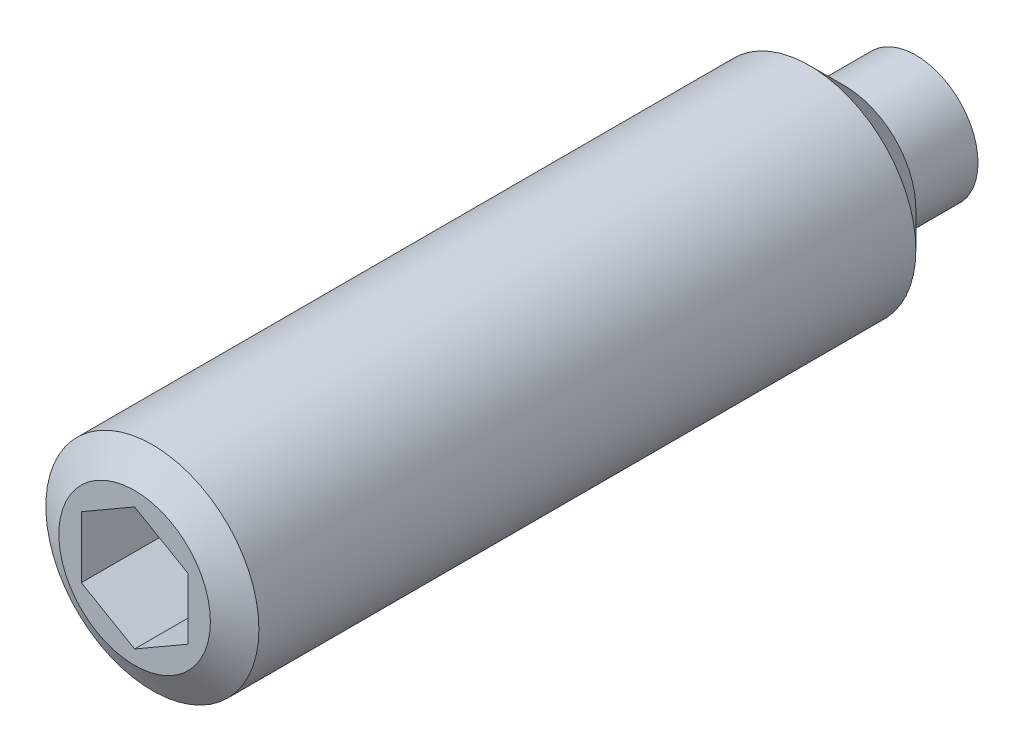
ISO-10303-21;
HEADER;
FILE_DESCRIPTION(('STEP AP214'),'2;1');
FILE_NAME('part.step','',(''),(''),'','','');
FILE_SCHEMA(('AUTOMOTIVE_DESIGN { 1 0 10303 214 1 1 1 1 }'));
ENDSEC;
DATA;
#1=APPLICATION_CONTEXT('core data for automotive mechanical design processes');
#2=APPLICATION_PROTOCOL_DEFINITION('international standard','automotive_design',2000,#1);
#3=PRODUCT_CONTEXT('',#1,'mechanical');
#4=PRODUCT('Part','Part','',(#3));
#5=PRODUCT_RELATED_PRODUCT_CATEGORY('part','',(#4));
#6=PRODUCT_DEFINITION_FORMATION('','',#4);
#7=PRODUCT_DEFINITION_CONTEXT('part definition',#1,'design');
#8=PRODUCT_DEFINITION('design','',#6,#7);
#9=PRODUCT_DEFINITION_SHAPE('','',#8);
#10=(LENGTH_UNIT() NAMED_UNIT(*) SI_UNIT(.MILLI.,.METRE.));
#11=(NAMED_UNIT(*) PLANE_ANGLE_UNIT() SI_UNIT($,.RADIAN.));
#12=(NAMED_UNIT(*) SI_UNIT($,.STERADIAN.) SOLID_ANGLE_UNIT());
#13=UNCERTAINTY_MEASURE_WITH_UNIT(LENGTH_MEASURE(1.E-05),#10,'distance_accuracy_value','');
#14=(GEOMETRIC_REPRESENTATION_CONTEXT(3) GLOBAL_UNCERTAINTY_ASSIGNED_CONTEXT((#13)) GLOBAL_UNIT_ASSIGNED_CONTEXT((#10,
#11,#12)) REPRESENTATION_CONTEXT('',''));
#15=CARTESIAN_POINT('',(0.,0.,0.));
#16=DIRECTION('',(0.,0.,1.));
#17=DIRECTION('',(1.,0.,0.));
#18=AXIS2_PLACEMENT_3D('',#15,#16,#17);
#19=CARTESIAN_POINT('',(1.75,0.,0.));
#20=DIRECTION('',(0.,0.,-1.));
#21=DIRECTION('',(-1.,0.,0.));
#22=AXIS2_PLACEMENT_3D('',#19,#20,#21);
#23=PLANE('',#22);
#24=CARTESIAN_POINT('',(0.,0.,0.));
#25=DIRECTION('',(0.,0.,1.));
#26=DIRECTION('',(1.,0.,0.));
#27=AXIS2_PLACEMENT_3D('',#24,#25,#26);
#28=CIRCLE('',#27,1.75);
#29=CARTESIAN_POINT('',(1.75,0.,0.));
#30=VERTEX_POINT('',#29);
#31=EDGE_CURVE('E124',#30,#30,#28,.T.);
#32=ORIENTED_EDGE('',*,*,#31,.F.);
#33=EDGE_LOOP('',(#32));
#34=FACE_BOUND('',#33,.T.);
#35=ADVANCED_FACE('F14',(#34),#23,.T.);
#36=CARTESIAN_POINT('',(0.,0.,42.));
#37=DIRECTION('',(0.,0.,1.));
#38=DIRECTION('',(1.,0.,0.));
#39=AXIS2_PLACEMENT_3D('',#36,#37,#38);
#40=CYLINDRICAL_SURFACE('',#39,1.75);
#41=CARTESIAN_POINT('',(0.,0.,2.));
#42=DIRECTION('',(0.,0.,1.));
#43=DIRECTION('',(1.,0.,0.));
#44=AXIS2_PLACEMENT_3D('',#41,#42,#43);
#45=CIRCLE('',#44,1.75);
#46=CARTESIAN_POINT('',(1.75,0.,2.));
#47=VERTEX_POINT('',#46);
#48=EDGE_CURVE('E121',#47,#47,#45,.T.);
#49=ORIENTED_EDGE('',*,*,#48,.F.);
#50=EDGE_LOOP('',(#49));
#51=FACE_BOUND('',#50,.T.);
#52=ORIENTED_EDGE('',*,*,#31,.T.);
#53=EDGE_LOOP('',(#52));
#54=FACE_BOUND('',#53,.T.);
#55=ADVANCED_FACE('F149',(#51,#54),#40,.T.);
#56=CARTESIAN_POINT('',(3.,0.,2.));
#57=DIRECTION('',(0.,0.,-1.));
#58=DIRECTION('',(-1.,0.,0.));
#59=AXIS2_PLACEMENT_3D('',#56,#57,#58);
#60=PLANE('',#59);
#61=CARTESIAN_POINT('',(0.,0.,2.));
#62=DIRECTION('',(0.,0.,-1.));
#63=DIRECTION('',(-1.,0.,0.));
#64=AXIS2_PLACEMENT_3D('',#61,#62,#63);
#65=CIRCLE('',#64,2.);
#66=CARTESIAN_POINT('',(-2.,0.,2.));
#67=VERTEX_POINT('',#66);
#68=EDGE_CURVE('E130',#67,#67,#65,.T.);
#69=ORIENTED_EDGE('',*,*,#68,.T.);
#70=EDGE_LOOP('',(#69));
#71=FACE_BOUND('',#70,.T.);
#72=ORIENTED_EDGE('',*,*,#48,.T.);
#73=EDGE_LOOP('',(#72));
#74=FACE_BOUND('',#73,.T.);
#75=ADVANCED_FACE('F155',(#71,#74),#60,.T.);
#76=CARTESIAN_POINT('',(0.,0.,42.));
#77=DIRECTION('',(0.,0.,1.));
#78=DIRECTION('',(1.,0.,0.));
#79=AXIS2_PLACEMENT_3D('',#76,#77,#78);
#80=CYLINDRICAL_SURFACE('',#79,3.);
#81=CARTESIAN_POINT('',(0.,0.,21.5));
#82=DIRECTION('',(0.,0.,1.));
#83=DIRECTION('',(1.,0.,0.));
#84=AXIS2_PLACEMENT_3D('',#81,#82,#83);
#85=CIRCLE('',#84,3.);
#86=CARTESIAN_POINT('',(3.,0.,21.5));
#87=VERTEX_POINT('',#86);
#88=EDGE_CURVE('E9',#87,#87,#85,.F.);
#89=ORIENTED_EDGE('',*,*,#88,.T.);
#90=EDGE_LOOP('',(#89));
#91=FACE_BOUND('',#90,.T.);
#92=CARTESIAN_POINT('',(0.,0.,3.));
#93=DIRECTION('',(0.,0.,-1.));
#94=DIRECTION('',(-1.,0.,0.));
#95=AXIS2_PLACEMENT_3D('',#92,#93,#94);
#96=CIRCLE('',#95,3.);
#97=CARTESIAN_POINT('',(-3.,0.,3.));
#98=VERTEX_POINT('',#97);
#99=EDGE_CURVE('E127',#98,#98,#96,.F.);
#100=ORIENTED_EDGE('',*,*,#99,.T.);
#101=EDGE_LOOP('',(#100));
#102=FACE_BOUND('',#101,.T.);
#103=ADVANCED_FACE('F162',(#91,#102),#80,.T.);
#104=CARTESIAN_POINT('',(0.,0.,22.));
#105=DIRECTION('',(0.,0.,1.));
#106=DIRECTION('',(1.,0.,0.));
#107=AXIS2_PLACEMENT_3D('',#104,#105,#106);
#108=PLANE('',#107);
#109=CARTESIAN_POINT('',(0.,0.,22.));
#110=DIRECTION('',(0.,0.,1.));
#111=DIRECTION('',(1.,0.,0.));
#112=AXIS2_PLACEMENT_3D('',#109,#110,#111);
#113=CIRCLE('',#112,2.13397459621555);
#114=CARTESIAN_POINT('',(2.13397459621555,0.,22.));
#115=VERTEX_POINT('',#114);
#116=EDGE_CURVE('E22',#115,#115,#113,.T.);
#117=ORIENTED_EDGE('',*,*,#116,.T.);
#118=EDGE_LOOP('',(#117));
#119=FACE_BOUND('',#118,.T.);
#120=DIRECTION('',(0.86602540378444,-0.5,0.));
#121=VECTOR('',#120,1.);
#122=CARTESIAN_POINT('',(-1.5,-0.866025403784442,22.));
#123=LINE('',#122,#121);
#124=CARTESIAN_POINT('',(-1.5,-0.866025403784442,22.));
#125=VERTEX_POINT('',#124);
#126=CARTESIAN_POINT('',(0.,-1.73205080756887,22.));
#127=VERTEX_POINT('',#126);
#128=EDGE_CURVE('E29',#125,#127,#123,.T.);
#129=ORIENTED_EDGE('',*,*,#128,.F.);
#130=DIRECTION('',(0.,-1.,0.));
#131=VECTOR('',#130,1.);
#132=CARTESIAN_POINT('',(-1.5,0.866025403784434,22.));
#133=LINE('',#132,#131);
#134=CARTESIAN_POINT('',(-1.5,0.866025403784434,22.));
#135=VERTEX_POINT('',#134);
#136=EDGE_CURVE('E97',#135,#125,#133,.T.);
#137=ORIENTED_EDGE('',*,*,#136,.F.);
#138=DIRECTION('',(0.866025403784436,0.5,0.));
#139=VECTOR('',#138,1.);
#140=CARTESIAN_POINT('',(-1.5,0.866025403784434,22.));
#141=LINE('',#140,#139);
#142=CARTESIAN_POINT('',(0.,1.73205080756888,22.));
#143=VERTEX_POINT('',#142);
#144=EDGE_CURVE('E92',#135,#143,#141,.T.);
#145=ORIENTED_EDGE('',*,*,#144,.T.);
#146=DIRECTION('',(-0.866025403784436,0.5,0.));
#147=VECTOR('',#146,1.);
#148=CARTESIAN_POINT('',(1.5,0.866025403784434,22.));
#149=LINE('',#148,#147);
#150=CARTESIAN_POINT('',(1.5,0.866025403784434,22.));
#151=VERTEX_POINT('',#150);
#152=EDGE_CURVE('E90',#151,#143,#149,.T.);
#153=ORIENTED_EDGE('',*,*,#152,.F.);
#154=DIRECTION('',(0.,-1.,0.));
#155=VECTOR('',#154,1.);
#156=CARTESIAN_POINT('',(1.5,0.866025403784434,22.));
#157=LINE('',#156,#155);
#158=CARTESIAN_POINT('',(1.5,-0.866025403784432,22.));
#159=VERTEX_POINT('',#158);
#160=EDGE_CURVE('E72',#151,#159,#157,.T.);
#161=ORIENTED_EDGE('',*,*,#160,.T.);
#162=DIRECTION('',(-0.866025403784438,-0.5,0.));
#163=VECTOR('',#162,1.);
#164=CARTESIAN_POINT('',(1.5,-0.866025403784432,22.));
#165=LINE('',#164,#163);
#166=EDGE_CURVE('E83',#159,#127,#165,.T.);
#167=ORIENTED_EDGE('',*,*,#166,.T.);
#168=EDGE_LOOP('',(#129,#137,#145,#153,#161,#167));
#169=FACE_BOUND('',#168,.T.);
#170=ADVANCED_FACE('F87',(#119,#169),#108,.T.);
#171=CARTESIAN_POINT('',(-1.5,-0.866025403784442,19.));
#172=DIRECTION('',(-0.5,-0.86602540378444,0.));
#173=DIRECTION('',(-0.86602540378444,0.5,0.));
#174=AXIS2_PLACEMENT_3D('',#171,#172,#173);
#175=PLANE('',#174);
#176=DIRECTION('',(0.,0.,1.));
#177=VECTOR('',#176,1.);
#178=CARTESIAN_POINT('',(-1.5,-0.866025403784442,19.));
#179=LINE('',#178,#177);
#180=CARTESIAN_POINT('',(-1.5,-0.866025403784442,19.));
#181=VERTEX_POINT('',#180);
#182=EDGE_CURVE('E36',#181,#125,#179,.T.);
#183=ORIENTED_EDGE('',*,*,#182,.T.);
#184=ORIENTED_EDGE('',*,*,#128,.T.);
#185=DIRECTION('',(0.,0.,1.));
#186=VECTOR('',#185,1.);
#187=CARTESIAN_POINT('',(0.,-1.73205080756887,19.));
#188=LINE('',#187,#186);
#189=CARTESIAN_POINT('',(0.,-1.73205080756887,19.));
#190=VERTEX_POINT('',#189);
#191=EDGE_CURVE('E80',#190,#127,#188,.T.);
#192=ORIENTED_EDGE('',*,*,#191,.F.);
#193=DIRECTION('',(0.86602540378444,-0.5,0.));
#194=VECTOR('',#193,1.);
#195=CARTESIAN_POINT('',(-1.5,-0.866025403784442,19.));
#196=LINE('',#195,#194);
#197=EDGE_CURVE('E99',#181,#190,#196,.T.);
#198=ORIENTED_EDGE('',*,*,#197,.F.);
#199=EDGE_LOOP('',(#183,#184,#192,#198));
#200=FACE_BOUND('',#199,.T.);
#201=ADVANCED_FACE('F169',(#200),#175,.F.);
#202=CARTESIAN_POINT('',(-1.5,0.866025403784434,19.));
#203=DIRECTION('',(-1.,0.,0.));
#204=DIRECTION('',(0.,1.,0.));
#205=AXIS2_PLACEMENT_3D('',#202,#203,#204);
#206=PLANE('',#205);
#207=DIRECTION('',(0.,0.,1.));
#208=VECTOR('',#207,1.);
#209=CARTESIAN_POINT('',(-1.5,0.866025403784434,19.));
#210=LINE('',#209,#208);
#211=CARTESIAN_POINT('',(-1.5,0.866025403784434,19.));
#212=VERTEX_POINT('',#211);
#213=EDGE_CURVE('E118',#212,#135,#210,.T.);
#214=ORIENTED_EDGE('',*,*,#213,.T.);
#215=ORIENTED_EDGE('',*,*,#136,.T.);
#216=ORIENTED_EDGE('',*,*,#182,.F.);
#217=DIRECTION('',(0.,-1.,0.));
#218=VECTOR('',#217,1.);
#219=CARTESIAN_POINT('',(-1.5,0.866025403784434,19.));
#220=LINE('',#219,#218);
#221=EDGE_CURVE('E111',#212,#181,#220,.T.);
#222=ORIENTED_EDGE('',*,*,#221,.F.);
#223=EDGE_LOOP('',(#214,#215,#216,#222));
#224=FACE_BOUND('',#223,.T.);
#225=ADVANCED_FACE('F170',(#224),#206,.F.);
#226=CARTESIAN_POINT('',(-1.5,0.866025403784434,19.));
#227=DIRECTION('',(0.5,-0.866025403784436,0.));
#228=DIRECTION('',(-0.866025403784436,-0.5,0.));
#229=AXIS2_PLACEMENT_3D('',#226,#227,#228);
#230=PLANE('',#229);
#231=DIRECTION('',(0.,0.,1.));
#232=VECTOR('',#231,1.);
#233=CARTESIAN_POINT('',(0.,1.73205080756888,19.));
#234=LINE('',#233,#232);
#235=CARTESIAN_POINT('',(0.,1.73205080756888,19.));
#236=VERTEX_POINT('',#235);
#237=EDGE_CURVE('E116',#236,#143,#234,.T.);
#238=ORIENTED_EDGE('',*,*,#237,.T.);
#239=ORIENTED_EDGE('',*,*,#144,.F.);
#240=ORIENTED_EDGE('',*,*,#213,.F.);
#241=DIRECTION('',(0.866025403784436,0.5,0.));
#242=VECTOR('',#241,1.);
#243=CARTESIAN_POINT('',(-1.5,0.866025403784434,19.));
#244=LINE('',#243,#242);
#245=EDGE_CURVE('E108',#212,#236,#244,.T.);
#246=ORIENTED_EDGE('',*,*,#245,.T.);
#247=EDGE_LOOP('',(#238,#239,#240,#246));
#248=FACE_BOUND('',#247,.T.);
#249=ADVANCED_FACE('F173',(#248),#230,.T.);
#250=CARTESIAN_POINT('',(1.5,0.866025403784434,19.));
#251=DIRECTION('',(0.5,0.866025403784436,0.));
#252=DIRECTION('',(0.866025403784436,-0.5,0.));
#253=AXIS2_PLACEMENT_3D('',#250,#251,#252);
#254=PLANE('',#253);
#255=DIRECTION('',(0.,0.,1.));
#256=VECTOR('',#255,1.);
#257=CARTESIAN_POINT('',(1.5,0.866025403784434,19.));
#258=LINE('',#257,#256);
#259=CARTESIAN_POINT('',(1.5,0.866025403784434,19.));
#260=VERTEX_POINT('',#259);
#261=EDGE_CURVE('E79',#260,#151,#258,.T.);
#262=ORIENTED_EDGE('',*,*,#261,.T.);
#263=ORIENTED_EDGE('',*,*,#152,.T.);
#264=ORIENTED_EDGE('',*,*,#237,.F.);
#265=DIRECTION('',(-0.866025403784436,0.5,0.));
#266=VECTOR('',#265,1.);
#267=CARTESIAN_POINT('',(1.5,0.866025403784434,19.));
#268=LINE('',#267,#266);
#269=EDGE_CURVE('E105',#260,#236,#268,.T.);
#270=ORIENTED_EDGE('',*,*,#269,.F.);
#271=EDGE_LOOP('',(#262,#263,#264,#270));
#272=FACE_BOUND('',#271,.T.);
#273=ADVANCED_FACE('F176',(#272),#254,.F.);
#274=CARTESIAN_POINT('',(1.5,0.866025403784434,19.));
#275=DIRECTION('',(-1.,0.,0.));
#276=DIRECTION('',(0.,1.,0.));
#277=AXIS2_PLACEMENT_3D('',#274,#275,#276);
#278=PLANE('',#277);
#279=DIRECTION('',(0.,0.,1.));
#280=VECTOR('',#279,1.);
#281=CARTESIAN_POINT('',(1.5,-0.866025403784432,19.));
#282=LINE('',#281,#280);
#283=CARTESIAN_POINT('',(1.5,-0.866025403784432,19.));
#284=VERTEX_POINT('',#283);
#285=EDGE_CURVE('E68',#284,#159,#282,.T.);
#286=ORIENTED_EDGE('',*,*,#285,.T.);
#287=ORIENTED_EDGE('',*,*,#160,.F.);
#288=ORIENTED_EDGE('',*,*,#261,.F.);
#289=DIRECTION('',(0.,-1.,0.));
#290=VECTOR('',#289,1.);
#291=CARTESIAN_POINT('',(1.5,0.866025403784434,19.));
#292=LINE('',#291,#290);
#293=EDGE_CURVE('E75',#260,#284,#292,.T.);
#294=ORIENTED_EDGE('',*,*,#293,.T.);
#295=EDGE_LOOP('',(#286,#287,#288,#294));
#296=FACE_BOUND('',#295,.T.);
#297=ADVANCED_FACE('F70',(#296),#278,.T.);
#298=CARTESIAN_POINT('',(1.5,-0.866025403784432,19.));
#299=DIRECTION('',(-0.5,0.866025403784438,0.));
#300=DIRECTION('',(0.866025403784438,0.5,0.));
#301=AXIS2_PLACEMENT_3D('',#298,#299,#300);
#302=PLANE('',#301);
#303=DIRECTION('',(-0.866025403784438,-0.5,0.));
#304=VECTOR('',#303,1.);
#305=CARTESIAN_POINT('',(1.5,-0.866025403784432,19.));
#306=LINE('',#305,#304);
#307=EDGE_CURVE('E102',#284,#190,#306,.T.);
#308=ORIENTED_EDGE('',*,*,#307,.T.);
#309=ORIENTED_EDGE('',*,*,#191,.T.);
#310=ORIENTED_EDGE('',*,*,#166,.F.);
#311=ORIENTED_EDGE('',*,*,#285,.F.);
#312=EDGE_LOOP('',(#308,#309,#310,#311));
#313=FACE_BOUND('',#312,.T.);
#314=ADVANCED_FACE('F84',(#313),#302,.T.);
#315=CARTESIAN_POINT('',(-1.5,-0.866025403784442,19.));
#316=DIRECTION('',(0.,0.,-1.));
#317=DIRECTION('',(-1.,0.,0.));
#318=AXIS2_PLACEMENT_3D('',#315,#316,#317);
#319=PLANE('',#318);
#320=ORIENTED_EDGE('',*,*,#197,.T.);
#321=ORIENTED_EDGE('',*,*,#307,.F.);
#322=ORIENTED_EDGE('',*,*,#293,.F.);
#323=ORIENTED_EDGE('',*,*,#269,.T.);
#324=ORIENTED_EDGE('',*,*,#245,.F.);
#325=ORIENTED_EDGE('',*,*,#221,.T.);
#326=EDGE_LOOP('',(#320,#321,#322,#323,#324,#325));
#327=FACE_BOUND('',#326,.T.);
#328=ADVANCED_FACE('F144',(#327),#319,.F.);
#329=CARTESIAN_POINT('',(0.,0.,3.));
#330=DIRECTION('',(0.,0.,1.));
#331=DIRECTION('',(1.,0.,0.));
#332=AXIS2_PLACEMENT_3D('',#329,#330,#331);
#333=CONICAL_SURFACE('',#332,3.,0.785398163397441);
#334=ORIENTED_EDGE('',*,*,#68,.F.);
#335=EDGE_LOOP('',(#334));
#336=FACE_BOUND('',#335,.T.);
#337=ORIENTED_EDGE('',*,*,#99,.F.);
#338=EDGE_LOOP('',(#337));
#339=FACE_BOUND('',#338,.T.);
#340=ADVANCED_FACE('F137',(#336,#339),#333,.T.);
#341=CARTESIAN_POINT('',(0.,0.,22.));
#342=DIRECTION('',(0.,0.,-1.));
#343=DIRECTION('',(-1.,0.,0.));
#344=AXIS2_PLACEMENT_3D('',#341,#342,#343);
#345=CONICAL_SURFACE('',#344,2.13397459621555,1.0471975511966);
#346=ORIENTED_EDGE('',*,*,#88,.F.);
#347=EDGE_LOOP('',(#346));
#348=FACE_BOUND('',#347,.T.);
#349=ORIENTED_EDGE('',*,*,#116,.F.);
#350=EDGE_LOOP('',(#349));
#351=FACE_BOUND('',#350,.T.);
#352=ADVANCED_FACE('F16',(#348,#351),#345,.T.);
#353=CLOSED_SHELL('',(#35,#55,#75,#103,#170,#201,#225,#249,#273,#297,#314,#328,#340,#352));
#354=MANIFOLD_SOLID_BREP('B1',#353);
#355=ADVANCED_BREP_SHAPE_REPRESENTATION('',(#18,#354),#14);
#356=SHAPE_DEFINITION_REPRESENTATION(#9,#355);
ENDSEC;
END-ISO-10303-21;
